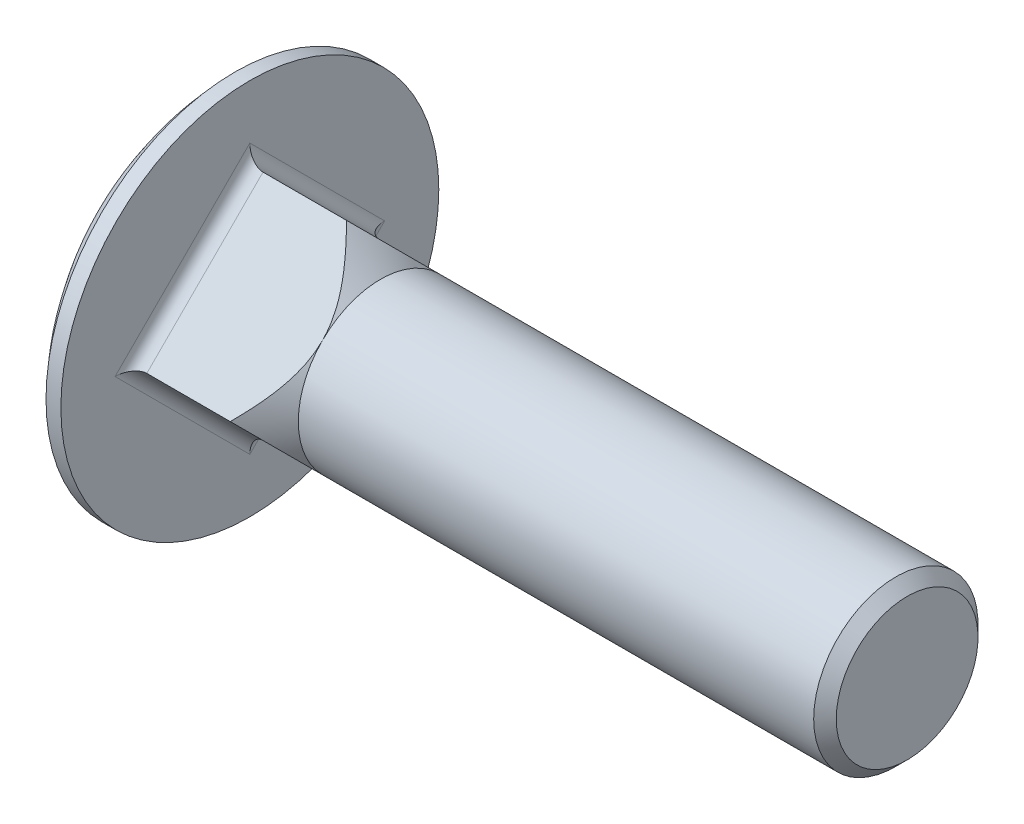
ISO-10303-21;
HEADER;
FILE_DESCRIPTION(('STEP AP214'),'2;1');
FILE_NAME('part.step','',(''),(''),'','','');
FILE_SCHEMA(('AUTOMOTIVE_DESIGN { 1 0 10303 214 1 1 1 1 }'));
ENDSEC;
DATA;
#1=APPLICATION_CONTEXT('core data for automotive mechanical design processes');
#2=APPLICATION_PROTOCOL_DEFINITION('international standard','automotive_design',2000,#1);
#3=PRODUCT_CONTEXT('',#1,'mechanical');
#4=PRODUCT('Part','Part','',(#3));
#5=PRODUCT_RELATED_PRODUCT_CATEGORY('part','',(#4));
#6=PRODUCT_DEFINITION_FORMATION('','',#4);
#7=PRODUCT_DEFINITION_CONTEXT('part definition',#1,'design');
#8=PRODUCT_DEFINITION('design','',#6,#7);
#9=PRODUCT_DEFINITION_SHAPE('','',#8);
#10=(LENGTH_UNIT() NAMED_UNIT(*) SI_UNIT(.MILLI.,.METRE.));
#11=(NAMED_UNIT(*) PLANE_ANGLE_UNIT() SI_UNIT($,.RADIAN.));
#12=(NAMED_UNIT(*) SI_UNIT($,.STERADIAN.) SOLID_ANGLE_UNIT());
#13=UNCERTAINTY_MEASURE_WITH_UNIT(LENGTH_MEASURE(1.E-05),#10,'distance_accuracy_value','');
#14=(GEOMETRIC_REPRESENTATION_CONTEXT(3) GLOBAL_UNCERTAINTY_ASSIGNED_CONTEXT((#13)) GLOBAL_UNIT_ASSIGNED_CONTEXT((#10,
#11,#12)) REPRESENTATION_CONTEXT('',''));
#15=CARTESIAN_POINT('',(0.,0.,0.));
#16=DIRECTION('',(0.,0.,1.));
#17=DIRECTION('',(1.,0.,0.));
#18=AXIS2_PLACEMENT_3D('',#15,#16,#17);
#19=CARTESIAN_POINT('',(26.8,0.,14.1421356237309));
#20=DIRECTION('',(0.,-0.707106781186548,-0.707106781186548));
#21=DIRECTION('',(0.,0.707106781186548,-0.707106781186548));
#22=AXIS2_PLACEMENT_3D('',#19,#20,#21);
#23=PLANE('',#22);
#24=DIRECTION('',(-1.,0.,0.));
#25=VECTOR('',#24,1.);
#26=CARTESIAN_POINT('',(26.8,14.1421356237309,0.));
#27=LINE('',#26,#25);
#28=CARTESIAN_POINT('',(22.6578643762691,14.1421356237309,0.));
#29=VERTEX_POINT('',#28);
#30=CARTESIAN_POINT('',(12.5,14.1421356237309,0.));
#31=VERTEX_POINT('',#30);
#32=EDGE_CURVE('E117',#29,#31,#27,.T.);
#33=ORIENTED_EDGE('',*,*,#32,.T.);
#34=DIRECTION('',(0.,0.707106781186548,-0.707106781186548));
#35=VECTOR('',#34,1.);
#36=CARTESIAN_POINT('',(12.5,0.,14.1421356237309));
#37=LINE('',#36,#35);
#38=CARTESIAN_POINT('',(12.5,0.,14.1421356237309));
#39=VERTEX_POINT('',#38);
#40=EDGE_CURVE('E210',#31,#39,#37,.F.);
#41=ORIENTED_EDGE('',*,*,#40,.T.);
#42=DIRECTION('',(-1.,0.,0.));
#43=VECTOR('',#42,1.);
#44=CARTESIAN_POINT('',(26.8,0.,14.1421356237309));
#45=LINE('',#44,#43);
#46=CARTESIAN_POINT('',(22.6578643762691,0.,14.1421356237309));
#47=VERTEX_POINT('',#46);
#48=EDGE_CURVE('E139',#47,#39,#45,.T.);
#49=ORIENTED_EDGE('',*,*,#48,.F.);
#50=CARTESIAN_POINT('',(22.6576643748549,14.1423356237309,-0.000199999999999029));
#51=CARTESIAN_POINT('',(22.8552392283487,13.9446994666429,0.197436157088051));
#52=CARTESIAN_POINT('',(23.0501556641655,13.7457030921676,0.396432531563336));
#53=CARTESIAN_POINT('',(23.4333984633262,13.3444369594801,0.797698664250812));
#54=CARTESIAN_POINT('',(23.6217218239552,13.1421657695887,0.99996985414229));
#55=CARTESIAN_POINT('',(23.9926271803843,12.7314246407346,1.41071098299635));
#56=CARTESIAN_POINT('',(24.1751080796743,12.5229088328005,1.61922679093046));
#57=CARTESIAN_POINT('',(24.5298995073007,12.1016083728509,2.04052725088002));
#58=CARTESIAN_POINT('',(24.7022111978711,11.8888242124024,2.25331141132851));
#59=CARTESIAN_POINT('',(25.0394769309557,11.4516566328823,2.69047899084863));
#60=CARTESIAN_POINT('',(25.2040327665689,11.2271185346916,2.91501708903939));
#61=CARTESIAN_POINT('',(25.5164765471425,10.7722142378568,3.36992138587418));
#62=CARTESIAN_POINT('',(25.6643613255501,10.5418469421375,3.60028868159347));
#63=CARTESIAN_POINT('',(25.9385679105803,10.0760560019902,4.06607962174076));
#64=CARTESIAN_POINT('',(26.0649930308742,9.84066310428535,4.3014725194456));
#65=CARTESIAN_POINT('',(26.2922366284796,9.36384804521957,4.77828757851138));
#66=CARTESIAN_POINT('',(26.3930711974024,9.1224297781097,5.01970584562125));
#67=CARTESIAN_POINT('',(26.5594298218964,8.64734642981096,5.49478919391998));
#68=CARTESIAN_POINT('',(26.6265684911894,8.41396806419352,5.72816755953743));
#69=CARTESIAN_POINT('',(26.7294988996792,7.94365931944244,6.1984763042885));
#70=CARTESIAN_POINT('',(26.7652837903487,7.70672817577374,6.43540744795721));
#71=CARTESIAN_POINT('',(26.8027880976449,7.23483443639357,6.90730118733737));
#72=CARTESIAN_POINT('',(26.8049784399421,6.99989086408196,7.14224475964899));
#73=CARTESIAN_POINT('',(26.776351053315,6.53102922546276,7.61110639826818));
#74=CARTESIAN_POINT('',(26.7455331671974,6.29711116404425,7.8450244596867));
#75=CARTESIAN_POINT('',(26.6532636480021,5.83397829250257,8.30815733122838));
#76=CARTESIAN_POINT('',(26.5920192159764,5.60474244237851,8.53739318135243));
#77=CARTESIAN_POINT('',(26.4425106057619,5.15076036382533,8.99137525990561));
#78=CARTESIAN_POINT('',(26.3542429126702,4.92601472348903,9.21612090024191));
#79=CARTESIAN_POINT('',(26.153488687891,4.47883245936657,9.66330316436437));
#80=CARTESIAN_POINT('',(26.0407010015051,4.25646429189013,9.88567133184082));
#81=CARTESIAN_POINT('',(25.7957378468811,3.81720389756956,10.3249317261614));
#82=CARTESIAN_POINT('',(25.6635628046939,3.60031155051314,10.5418240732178));
#83=CARTESIAN_POINT('',(25.325134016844,3.0824777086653,11.0596579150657));
#84=CARTESIAN_POINT('',(25.1109497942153,2.78414006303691,11.357995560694));
#85=CARTESIAN_POINT('',(24.6590340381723,2.19639988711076,11.9457357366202));
#86=CARTESIAN_POINT('',(24.4212871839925,1.90700333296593,12.235132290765));
#87=CARTESIAN_POINT('',(24.0552264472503,1.48299272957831,12.6591428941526));
#88=CARTESIAN_POINT('',(23.9336313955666,1.34544247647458,12.7966931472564));
#89=CARTESIAN_POINT('',(23.6868013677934,1.07197750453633,13.0701581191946));
#90=CARTESIAN_POINT('',(23.5615663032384,0.936062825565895,13.2060727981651));
#91=CARTESIAN_POINT('',(23.3081456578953,0.665971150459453,13.4761644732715));
#92=CARTESIAN_POINT('',(23.1799657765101,0.531791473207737,13.6103441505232));
#93=CARTESIAN_POINT('',(22.9208176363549,0.26480345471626,13.8773321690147));
#94=CARTESIAN_POINT('',(22.7898496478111,0.131994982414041,14.0101406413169));
#95=CARTESIAN_POINT('',(22.6576643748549,-0.000200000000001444,14.1423356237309));
#96=B_SPLINE_CURVE_WITH_KNOTS('',3,(#50,#51,#52,#53,#54,#55,#56,#57,#58,#59,#60,#61,#62,#63,#64,
#65,#66,#67,#68,#69,#70,#71,#72,#73,#74,#75,#76,#77,#78,#79,#80,#81,#82,#83,#84,#85,#86,#87,#88,
#89,#90,#91,#92,#93,#94,#95),.UNSPECIFIED.,.F.,.F.,(4,2,2,2,2,2,2,2,2,2,2,2,2,2,2,2,2,2,2,2,2,2,
4),(0.,1.02687972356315,2.05422119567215,3.09439498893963,4.13444967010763,5.20700647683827,
6.27976666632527,7.3472059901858,8.41397242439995,9.42305133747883,10.4323506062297,
11.4274884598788,12.4226310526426,13.4110878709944,14.3996733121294,15.4011657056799,
16.4026360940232,17.8210687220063,19.2404297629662,19.9286061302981,20.6167992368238,
21.3037570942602,21.990648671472),.UNSPECIFIED.);
#97=CARTESIAN_POINT('',(26.8,7.07106781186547,7.07106781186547));
#98=VERTEX_POINT('',#97);
#99=EDGE_CURVE('E118',#98,#47,#96,.T.);
#100=ORIENTED_EDGE('',*,*,#99,.F.);
#101=EDGE_CURVE('E105',#29,#98,#96,.T.);
#102=ORIENTED_EDGE('',*,*,#101,.F.);
#103=EDGE_LOOP('',(#33,#41,#49,#100,#102));
#104=FACE_BOUND('',#103,.T.);
#105=ADVANCED_FACE('F37',(#104),#23,.F.);
#106=CARTESIAN_POINT('',(26.8,-14.1421356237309,0.));
#107=DIRECTION('',(0.,0.707106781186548,-0.707106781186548));
#108=DIRECTION('',(0.,0.707106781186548,0.707106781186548));
#109=AXIS2_PLACEMENT_3D('',#106,#107,#108);
#110=PLANE('',#109);
#111=ORIENTED_EDGE('',*,*,#48,.T.);
#112=DIRECTION('',(0.,0.707106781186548,0.707106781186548));
#113=VECTOR('',#112,1.);
#114=CARTESIAN_POINT('',(12.5,-14.1421356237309,0.));
#115=LINE('',#114,#113);
#116=CARTESIAN_POINT('',(12.5,-14.1421356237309,0.));
#117=VERTEX_POINT('',#116);
#118=EDGE_CURVE('E61',#39,#117,#115,.F.);
#119=ORIENTED_EDGE('',*,*,#118,.T.);
#120=DIRECTION('',(-1.,0.,0.));
#121=VECTOR('',#120,1.);
#122=CARTESIAN_POINT('',(26.8,-14.1421356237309,0.));
#123=LINE('',#122,#121);
#124=CARTESIAN_POINT('',(22.6578643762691,-14.1421356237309,0.));
#125=VERTEX_POINT('',#124);
#126=EDGE_CURVE('E186',#125,#117,#123,.T.);
#127=ORIENTED_EDGE('',*,*,#126,.F.);
#128=CARTESIAN_POINT('',(22.6576643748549,0.000199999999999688,14.1423356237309));
#129=CARTESIAN_POINT('',(22.8552392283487,-0.197436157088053,13.9446994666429));
#130=CARTESIAN_POINT('',(23.0501556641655,-0.396432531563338,13.7457030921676));
#131=CARTESIAN_POINT('',(23.4333984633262,-0.797698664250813,13.3444369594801));
#132=CARTESIAN_POINT('',(23.6217218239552,-0.99996985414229,13.1421657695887));
#133=CARTESIAN_POINT('',(23.9926271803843,-1.41071098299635,12.7314246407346));
#134=CARTESIAN_POINT('',(24.1751080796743,-1.61922679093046,12.5229088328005));
#135=CARTESIAN_POINT('',(24.5298995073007,-2.04052725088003,12.1016083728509));
#136=CARTESIAN_POINT('',(24.7022111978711,-2.25331141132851,11.8888242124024));
#137=CARTESIAN_POINT('',(25.0394769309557,-2.69047899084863,11.4516566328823));
#138=CARTESIAN_POINT('',(25.2040327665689,-2.91501708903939,11.2271185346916));
#139=CARTESIAN_POINT('',(25.5164765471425,-3.36992138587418,10.7722142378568));
#140=CARTESIAN_POINT('',(25.6643613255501,-3.60028868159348,10.5418469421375));
#141=CARTESIAN_POINT('',(25.9385679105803,-4.06607962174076,10.0760560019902));
#142=CARTESIAN_POINT('',(26.0649930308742,-4.3014725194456,9.84066310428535));
#143=CARTESIAN_POINT('',(26.2922366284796,-4.77828757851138,9.36384804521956));
#144=CARTESIAN_POINT('',(26.3930711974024,-5.01970584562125,9.12242977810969));
#145=CARTESIAN_POINT('',(26.5594298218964,-5.49478919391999,8.64734642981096));
#146=CARTESIAN_POINT('',(26.6265684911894,-5.72816755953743,8.41396806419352));
#147=CARTESIAN_POINT('',(26.7294988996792,-6.19847630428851,7.94365931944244));
#148=CARTESIAN_POINT('',(26.7652837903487,-6.43540744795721,7.70672817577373));
#149=CARTESIAN_POINT('',(26.8027880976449,-6.90730118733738,7.23483443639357));
#150=CARTESIAN_POINT('',(26.8049784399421,-7.14224475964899,6.99989086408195));
#151=CARTESIAN_POINT('',(26.776351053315,-7.61110639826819,6.53102922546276));
#152=CARTESIAN_POINT('',(26.7455331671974,-7.8450244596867,6.29711116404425));
#153=CARTESIAN_POINT('',(26.6532636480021,-8.30815733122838,5.83397829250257));
#154=CARTESIAN_POINT('',(26.5920192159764,-8.53739318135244,5.60474244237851));
#155=CARTESIAN_POINT('',(26.4425106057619,-8.99137525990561,5.15076036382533));
#156=CARTESIAN_POINT('',(26.3542429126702,-9.21612090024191,4.92601472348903));
#157=CARTESIAN_POINT('',(26.153488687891,-9.66330316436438,4.47883245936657));
#158=CARTESIAN_POINT('',(26.0407010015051,-9.88567133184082,4.25646429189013));
#159=CARTESIAN_POINT('',(25.7957378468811,-10.3249317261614,3.81720389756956));
#160=CARTESIAN_POINT('',(25.6635628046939,-10.5418240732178,3.60031155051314));
#161=CARTESIAN_POINT('',(25.325134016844,-11.0596579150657,3.0824777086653));
#162=CARTESIAN_POINT('',(25.1109497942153,-11.357995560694,2.78414006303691));
#163=CARTESIAN_POINT('',(24.6590340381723,-11.9457357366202,2.19639988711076));
#164=CARTESIAN_POINT('',(24.4212871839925,-12.235132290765,1.90700333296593));
#165=CARTESIAN_POINT('',(24.0552264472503,-12.6591428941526,1.48299272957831));
#166=CARTESIAN_POINT('',(23.9336313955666,-12.7966931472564,1.34544247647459));
#167=CARTESIAN_POINT('',(23.6868013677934,-13.0701581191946,1.07197750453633));
#168=CARTESIAN_POINT('',(23.5615663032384,-13.206072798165,0.936062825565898));
#169=CARTESIAN_POINT('',(23.3081456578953,-13.4761644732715,0.665971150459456));
#170=CARTESIAN_POINT('',(23.1799657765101,-13.6103441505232,0.531791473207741));
#171=CARTESIAN_POINT('',(22.9208176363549,-13.8773321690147,0.264803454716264));
#172=CARTESIAN_POINT('',(22.7898496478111,-14.0101406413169,0.131994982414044));
#173=CARTESIAN_POINT('',(22.6576643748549,-14.1423356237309,-0.000200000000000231));
#174=B_SPLINE_CURVE_WITH_KNOTS('',3,(#128,#129,#130,#131,#132,#133,#134,#135,#136,#137,#138,
#139,#140,#141,#142,#143,#144,#145,#146,#147,#148,#149,#150,#151,#152,#153,#154,#155,#156,#157,
#158,#159,#160,#161,#162,#163,#164,#165,#166,#167,#168,#169,#170,#171,#172,#173),.UNSPECIFIED.,
.F.,.F.,(4,2,2,2,2,2,2,2,2,2,2,2,2,2,2,2,2,2,2,2,2,2,4),(0.,1.02687972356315,2.05422119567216,
3.09439498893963,4.13444967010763,5.20700647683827,6.27976666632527,7.3472059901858,
8.41397242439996,9.42305133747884,10.4323506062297,11.4274884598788,12.4226310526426,
13.4110878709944,14.3996733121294,15.4011657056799,16.4026360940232,17.8210687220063,
19.2404297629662,19.9286061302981,20.6167992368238,21.3037570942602,21.990648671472),.UNSPECIFIED.);
#175=CARTESIAN_POINT('',(26.8,-7.07106781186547,7.07106781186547));
#176=VERTEX_POINT('',#175);
#177=EDGE_CURVE('E140',#176,#125,#174,.T.);
#178=ORIENTED_EDGE('',*,*,#177,.F.);
#179=EDGE_CURVE('E126',#47,#176,#174,.T.);
#180=ORIENTED_EDGE('',*,*,#179,.F.);
#181=EDGE_LOOP('',(#111,#119,#127,#178,#180));
#182=FACE_BOUND('',#181,.T.);
#183=ADVANCED_FACE('F179',(#182),#110,.F.);
#184=CARTESIAN_POINT('',(26.8,0.,-14.1421356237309));
#185=DIRECTION('',(0.,0.707106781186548,0.707106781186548));
#186=DIRECTION('',(0.,-0.707106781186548,0.707106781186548));
#187=AXIS2_PLACEMENT_3D('',#184,#185,#186);
#188=PLANE('',#187);
#189=ORIENTED_EDGE('',*,*,#126,.T.);
#190=DIRECTION('',(0.,-0.707106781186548,0.707106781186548));
#191=VECTOR('',#190,1.);
#192=CARTESIAN_POINT('',(12.5,0.,-14.1421356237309));
#193=LINE('',#192,#191);
#194=CARTESIAN_POINT('',(12.5,0.,-14.1421356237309));
#195=VERTEX_POINT('',#194);
#196=EDGE_CURVE('E46',#117,#195,#193,.F.);
#197=ORIENTED_EDGE('',*,*,#196,.T.);
#198=DIRECTION('',(-1.,0.,0.));
#199=VECTOR('',#198,1.);
#200=CARTESIAN_POINT('',(26.8,0.,-14.1421356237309));
#201=LINE('',#200,#199);
#202=CARTESIAN_POINT('',(22.6578643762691,0.,-14.1421356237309));
#203=VERTEX_POINT('',#202);
#204=EDGE_CURVE('E191',#203,#195,#201,.T.);
#205=ORIENTED_EDGE('',*,*,#204,.F.);
#206=CARTESIAN_POINT('',(22.6576643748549,-14.1423356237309,0.000199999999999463));
#207=CARTESIAN_POINT('',(22.8552392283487,-13.9446994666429,-0.197436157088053));
#208=CARTESIAN_POINT('',(23.0501556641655,-13.7457030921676,-0.396432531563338));
#209=CARTESIAN_POINT('',(23.4333984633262,-13.3444369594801,-0.797698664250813));
#210=CARTESIAN_POINT('',(23.6217218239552,-13.1421657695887,-0.99996985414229));
#211=CARTESIAN_POINT('',(23.9926271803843,-12.7314246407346,-1.41071098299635));
#212=CARTESIAN_POINT('',(24.1751080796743,-12.5229088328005,-1.61922679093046));
#213=CARTESIAN_POINT('',(24.5298995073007,-12.1016083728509,-2.04052725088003));
#214=CARTESIAN_POINT('',(24.7022111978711,-11.8888242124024,-2.25331141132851));
#215=CARTESIAN_POINT('',(25.0394769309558,-11.4516566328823,-2.69047899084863));
#216=CARTESIAN_POINT('',(25.2040327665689,-11.2271185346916,-2.91501708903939));
#217=CARTESIAN_POINT('',(25.5164765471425,-10.7722142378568,-3.36992138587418));
#218=CARTESIAN_POINT('',(25.6643613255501,-10.5418469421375,-3.60028868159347));
#219=CARTESIAN_POINT('',(25.9385679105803,-10.0760560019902,-4.06607962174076));
#220=CARTESIAN_POINT('',(26.0649930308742,-9.84066310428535,-4.3014725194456));
#221=CARTESIAN_POINT('',(26.2922366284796,-9.36384804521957,-4.77828757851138));
#222=CARTESIAN_POINT('',(26.3930711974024,-9.1224297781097,-5.01970584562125));
#223=CARTESIAN_POINT('',(26.5594298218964,-8.64734642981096,-5.49478919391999));
#224=CARTESIAN_POINT('',(26.6265684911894,-8.41396806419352,-5.72816755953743));
#225=CARTESIAN_POINT('',(26.7294988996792,-7.94365931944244,-6.19847630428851));
#226=CARTESIAN_POINT('',(26.7652837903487,-7.70672817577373,-6.43540744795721));
#227=CARTESIAN_POINT('',(26.8027880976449,-7.23483443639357,-6.90730118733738));
#228=CARTESIAN_POINT('',(26.8049784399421,-6.99989086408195,-7.142244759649));
#229=CARTESIAN_POINT('',(26.776351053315,-6.53102922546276,-7.61110639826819));
#230=CARTESIAN_POINT('',(26.7455331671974,-6.29711116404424,-7.8450244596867));
#231=CARTESIAN_POINT('',(26.6532636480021,-5.83397829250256,-8.30815733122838));
#232=CARTESIAN_POINT('',(26.5920192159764,-5.60474244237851,-8.53739318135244));
#233=CARTESIAN_POINT('',(26.4425106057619,-5.15076036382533,-8.99137525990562));
#234=CARTESIAN_POINT('',(26.3542429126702,-4.92601472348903,-9.21612090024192));
#235=CARTESIAN_POINT('',(26.153488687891,-4.47883245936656,-9.66330316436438));
#236=CARTESIAN_POINT('',(26.0407010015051,-4.25646429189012,-9.88567133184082));
#237=CARTESIAN_POINT('',(25.7957378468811,-3.81720389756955,-10.3249317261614));
#238=CARTESIAN_POINT('',(25.6635628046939,-3.60031155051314,-10.5418240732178));
#239=CARTESIAN_POINT('',(25.325134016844,-3.08247770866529,-11.0596579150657));
#240=CARTESIAN_POINT('',(25.1109497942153,-2.78414006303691,-11.357995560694));
#241=CARTESIAN_POINT('',(24.6590340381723,-2.19639988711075,-11.9457357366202));
#242=CARTESIAN_POINT('',(24.4212871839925,-1.90700333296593,-12.235132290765));
#243=CARTESIAN_POINT('',(24.0552264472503,-1.48299272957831,-12.6591428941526));
#244=CARTESIAN_POINT('',(23.9336313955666,-1.34544247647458,-12.7966931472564));
#245=CARTESIAN_POINT('',(23.6868013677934,-1.07197750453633,-13.0701581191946));
#246=CARTESIAN_POINT('',(23.5615663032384,-0.936062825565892,-13.2060727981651));
#247=CARTESIAN_POINT('',(23.3081456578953,-0.66597115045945,-13.4761644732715));
#248=CARTESIAN_POINT('',(23.1799657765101,-0.531791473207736,-13.6103441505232));
#249=CARTESIAN_POINT('',(22.9208176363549,-0.26480345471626,-13.8773321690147));
#250=CARTESIAN_POINT('',(22.7898496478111,-0.131994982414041,-14.0101406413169));
#251=CARTESIAN_POINT('',(22.6576643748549,0.000200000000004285,-14.142335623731));
#252=B_SPLINE_CURVE_WITH_KNOTS('',3,(#206,#207,#208,#209,#210,#211,#212,#213,#214,#215,#216,
#217,#218,#219,#220,#221,#222,#223,#224,#225,#226,#227,#228,#229,#230,#231,#232,#233,#234,#235,
#236,#237,#238,#239,#240,#241,#242,#243,#244,#245,#246,#247,#248,#249,#250,#251),.UNSPECIFIED.,
.F.,.F.,(4,2,2,2,2,2,2,2,2,2,2,2,2,2,2,2,2,2,2,2,2,2,4),(0.,1.02687972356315,2.05422119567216,
3.09439498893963,4.13444967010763,5.20700647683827,6.27976666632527,7.3472059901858,
8.41397242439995,9.42305133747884,10.4323506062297,11.4274884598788,12.4226310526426,
13.4110878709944,14.3996733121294,15.4011657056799,16.4026360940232,17.8210687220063,
19.2404297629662,19.9286061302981,20.6167992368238,21.3037570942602,21.990648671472),.UNSPECIFIED.);
#253=CARTESIAN_POINT('',(26.8,-7.07106781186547,-7.07106781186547));
#254=VERTEX_POINT('',#253);
#255=EDGE_CURVE('E170',#254,#203,#252,.T.);
#256=ORIENTED_EDGE('',*,*,#255,.F.);
#257=EDGE_CURVE('E174',#125,#254,#252,.T.);
#258=ORIENTED_EDGE('',*,*,#257,.F.);
#259=EDGE_LOOP('',(#189,#197,#205,#256,#258));
#260=FACE_BOUND('',#259,.T.);
#261=ADVANCED_FACE('F176',(#260),#188,.F.);
#262=CARTESIAN_POINT('',(26.8,14.1421356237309,0.));
#263=DIRECTION('',(0.,-0.707106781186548,0.707106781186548));
#264=DIRECTION('',(0.,-0.707106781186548,-0.707106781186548));
#265=AXIS2_PLACEMENT_3D('',#262,#263,#264);
#266=PLANE('',#265);
#267=ORIENTED_EDGE('',*,*,#204,.T.);
#268=DIRECTION('',(0.,-0.707106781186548,-0.707106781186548));
#269=VECTOR('',#268,1.);
#270=CARTESIAN_POINT('',(12.5,14.1421356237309,0.));
#271=LINE('',#270,#269);
#272=EDGE_CURVE('E11',#195,#31,#271,.F.);
#273=ORIENTED_EDGE('',*,*,#272,.T.);
#274=ORIENTED_EDGE('',*,*,#32,.F.);
#275=CARTESIAN_POINT('',(22.6576643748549,-0.000200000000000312,-14.1423356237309));
#276=CARTESIAN_POINT('',(22.8552392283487,0.197436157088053,-13.9446994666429));
#277=CARTESIAN_POINT('',(23.0501556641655,0.396432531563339,-13.7457030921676));
#278=CARTESIAN_POINT('',(23.4333984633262,0.797698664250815,-13.3444369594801));
#279=CARTESIAN_POINT('',(23.6217218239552,0.999969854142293,-13.1421657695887));
#280=CARTESIAN_POINT('',(23.9926271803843,1.41071098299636,-12.7314246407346));
#281=CARTESIAN_POINT('',(24.1751080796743,1.61922679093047,-12.5229088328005));
#282=CARTESIAN_POINT('',(24.5298995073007,2.04052725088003,-12.1016083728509));
#283=CARTESIAN_POINT('',(24.7022111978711,2.25331141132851,-11.8888242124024));
#284=CARTESIAN_POINT('',(25.0394769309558,2.69047899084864,-11.4516566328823));
#285=CARTESIAN_POINT('',(25.2040327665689,2.91501708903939,-11.2271185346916));
#286=CARTESIAN_POINT('',(25.5164765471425,3.36992138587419,-10.7722142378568));
#287=CARTESIAN_POINT('',(25.6643613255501,3.60028868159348,-10.5418469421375));
#288=CARTESIAN_POINT('',(25.9385679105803,4.06607962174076,-10.0760560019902));
#289=CARTESIAN_POINT('',(26.0649930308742,4.3014725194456,-9.84066310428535));
#290=CARTESIAN_POINT('',(26.2922366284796,4.77828757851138,-9.36384804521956));
#291=CARTESIAN_POINT('',(26.3930711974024,5.01970584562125,-9.12242977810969));
#292=CARTESIAN_POINT('',(26.5594298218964,5.49478919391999,-8.64734642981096));
#293=CARTESIAN_POINT('',(26.6265684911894,5.72816755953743,-8.41396806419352));
#294=CARTESIAN_POINT('',(26.7294988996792,6.19847630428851,-7.94365931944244));
#295=CARTESIAN_POINT('',(26.7652837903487,6.43540744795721,-7.70672817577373));
#296=CARTESIAN_POINT('',(26.8027880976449,6.90730118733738,-7.23483443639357));
#297=CARTESIAN_POINT('',(26.8049784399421,7.142244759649,-6.99989086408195));
#298=CARTESIAN_POINT('',(26.776351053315,7.61110639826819,-6.53102922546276));
#299=CARTESIAN_POINT('',(26.7455331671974,7.8450244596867,-6.29711116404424));
#300=CARTESIAN_POINT('',(26.6532636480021,8.30815733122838,-5.83397829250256));
#301=CARTESIAN_POINT('',(26.5920192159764,8.53739318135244,-5.60474244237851));
#302=CARTESIAN_POINT('',(26.4425106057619,8.99137525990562,-5.15076036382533));
#303=CARTESIAN_POINT('',(26.3542429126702,9.21612090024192,-4.92601472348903));
#304=CARTESIAN_POINT('',(26.153488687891,9.66330316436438,-4.47883245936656));
#305=CARTESIAN_POINT('',(26.0407010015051,9.88567133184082,-4.25646429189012));
#306=CARTESIAN_POINT('',(25.7957378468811,10.3249317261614,-3.81720389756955));
#307=CARTESIAN_POINT('',(25.6635628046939,10.5418240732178,-3.60031155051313));
#308=CARTESIAN_POINT('',(25.325134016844,11.0596579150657,-3.08247770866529));
#309=CARTESIAN_POINT('',(25.1109497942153,11.357995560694,-2.78414006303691));
#310=CARTESIAN_POINT('',(24.6590340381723,11.9457357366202,-2.19639988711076));
#311=CARTESIAN_POINT('',(24.4212871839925,12.235132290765,-1.90700333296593));
#312=CARTESIAN_POINT('',(24.0552264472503,12.6591428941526,-1.48299272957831));
#313=CARTESIAN_POINT('',(23.9336313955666,12.7966931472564,-1.34544247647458));
#314=CARTESIAN_POINT('',(23.6868013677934,13.0701581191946,-1.07197750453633));
#315=CARTESIAN_POINT('',(23.5615663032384,13.2060727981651,-0.936062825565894));
#316=CARTESIAN_POINT('',(23.3081456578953,13.4761644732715,-0.665971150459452));
#317=CARTESIAN_POINT('',(23.1799657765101,13.6103441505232,-0.531791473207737));
#318=CARTESIAN_POINT('',(22.9208176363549,13.8773321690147,-0.264803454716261));
#319=CARTESIAN_POINT('',(22.7898496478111,14.0101406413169,-0.131994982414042));
#320=CARTESIAN_POINT('',(22.6576643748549,14.1423356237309,0.000200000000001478));
#321=B_SPLINE_CURVE_WITH_KNOTS('',3,(#275,#276,#277,#278,#279,#280,#281,#282,#283,#284,#285,
#286,#287,#288,#289,#290,#291,#292,#293,#294,#295,#296,#297,#298,#299,#300,#301,#302,#303,#304,
#305,#306,#307,#308,#309,#310,#311,#312,#313,#314,#315,#316,#317,#318,#319,#320),.UNSPECIFIED.,
.F.,.F.,(4,2,2,2,2,2,2,2,2,2,2,2,2,2,2,2,2,2,2,2,2,2,4),(0.,1.02687972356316,2.05422119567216,
3.09439498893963,4.13444967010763,5.20700647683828,6.27976666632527,7.34720599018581,
8.41397242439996,9.42305133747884,10.4323506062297,11.4274884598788,12.4226310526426,
13.4110878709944,14.3996733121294,15.4011657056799,16.4026360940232,17.8210687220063,
19.2404297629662,19.9286061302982,20.6167992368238,21.3037570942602,21.990648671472),.UNSPECIFIED.);
#322=CARTESIAN_POINT('',(26.8,7.07106781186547,-7.07106781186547));
#323=VERTEX_POINT('',#322);
#324=EDGE_CURVE('E112',#323,#29,#321,.T.);
#325=ORIENTED_EDGE('',*,*,#324,.F.);
#326=EDGE_CURVE('E175',#203,#323,#321,.T.);
#327=ORIENTED_EDGE('',*,*,#326,.F.);
#328=EDGE_LOOP('',(#267,#273,#274,#325,#327));
#329=FACE_BOUND('',#328,.T.);
#330=ADVANCED_FACE('F160',(#329),#266,.F.);
#331=CARTESIAN_POINT('',(33.641289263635,0.,0.));
#332=DIRECTION('',(-1.,0.,0.));
#333=DIRECTION('',(0.,1.,0.));
#334=AXIS2_PLACEMENT_3D('',#331,#332,#333);
#335=SPHERICAL_SURFACE('',#334,33.641289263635);
#336=CARTESIAN_POINT('',(9.09059999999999,0.,0.));
#337=DIRECTION('',(-1.,0.,0.));
#338=DIRECTION('',(0.,0.,1.));
#339=AXIS2_PLACEMENT_3D('',#336,#337,#338);
#340=CIRCLE('',#339,23.);
#341=CARTESIAN_POINT('',(9.09059999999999,0.,23.));
#342=VERTEX_POINT('',#341);
#343=EDGE_CURVE('E185',#342,#342,#340,.T.);
#344=ORIENTED_EDGE('',*,*,#343,.T.);
#345=EDGE_LOOP('',(#344));
#346=FACE_BOUND('',#345,.T.);
#347=ADVANCED_FACE('F250',(#346),#335,.T.);
#348=CARTESIAN_POINT('',(-31.75,0.,0.));
#349=DIRECTION('',(-1.,0.,0.));
#350=DIRECTION('',(0.,0.,1.));
#351=AXIS2_PLACEMENT_3D('',#348,#349,#350);
#352=CYLINDRICAL_SURFACE('',#351,23.);
#353=CARTESIAN_POINT('',(10.9,0.,0.));
#354=DIRECTION('',(-1.,0.,0.));
#355=DIRECTION('',(0.,0.,1.));
#356=AXIS2_PLACEMENT_3D('',#353,#354,#355);
#357=CIRCLE('',#356,23.);
#358=CARTESIAN_POINT('',(10.9,0.,23.));
#359=VERTEX_POINT('',#358);
#360=EDGE_CURVE('E189',#359,#359,#357,.T.);
#361=ORIENTED_EDGE('',*,*,#360,.T.);
#362=EDGE_LOOP('',(#361));
#363=FACE_BOUND('',#362,.T.);
#364=ORIENTED_EDGE('',*,*,#343,.F.);
#365=EDGE_LOOP('',(#364));
#366=FACE_BOUND('',#365,.T.);
#367=ADVANCED_FACE('F253',(#363,#366),#352,.T.);
#368=CARTESIAN_POINT('',(10.9,23.,0.));
#369=DIRECTION('',(1.,0.,0.));
#370=DIRECTION('',(0.,0.,-1.));
#371=AXIS2_PLACEMENT_3D('',#368,#369,#370);
#372=PLANE('',#371);
#373=DIRECTION('',(0.,0.707106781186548,0.707106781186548));
#374=VECTOR('',#373,1.);
#375=CARTESIAN_POINT('',(10.9,3.29756133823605,19.7024386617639));
#376=LINE('',#375,#374);
#377=CARTESIAN_POINT('',(10.9,-16.4048773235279,0.));
#378=VERTEX_POINT('',#377);
#379=CARTESIAN_POINT('',(10.9,0.,16.4048773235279));
#380=VERTEX_POINT('',#379);
#381=EDGE_CURVE('E205',#378,#380,#376,.T.);
#382=ORIENTED_EDGE('',*,*,#381,.T.);
#383=DIRECTION('',(0.,0.707106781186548,-0.707106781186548));
#384=VECTOR('',#383,1.);
#385=CARTESIAN_POINT('',(10.9,19.702438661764,-3.29756133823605));
#386=LINE('',#385,#384);
#387=CARTESIAN_POINT('',(10.9,16.4048773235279,0.));
#388=VERTEX_POINT('',#387);
#389=EDGE_CURVE('E207',#380,#388,#386,.T.);
#390=ORIENTED_EDGE('',*,*,#389,.T.);
#391=DIRECTION('',(0.,-0.707106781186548,-0.707106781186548));
#392=VECTOR('',#391,1.);
#393=CARTESIAN_POINT('',(10.9,19.7024386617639,3.29756133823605));
#394=LINE('',#393,#392);
#395=CARTESIAN_POINT('',(10.9,0.,-16.4048773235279));
#396=VERTEX_POINT('',#395);
#397=EDGE_CURVE('E201',#388,#396,#394,.T.);
#398=ORIENTED_EDGE('',*,*,#397,.T.);
#399=DIRECTION('',(0.,-0.707106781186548,0.707106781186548));
#400=VECTOR('',#399,1.);
#401=CARTESIAN_POINT('',(10.9,3.29756133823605,-19.7024386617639));
#402=LINE('',#401,#400);
#403=EDGE_CURVE('E203',#396,#378,#402,.T.);
#404=ORIENTED_EDGE('',*,*,#403,.T.);
#405=EDGE_LOOP('',(#382,#390,#398,#404));
#406=FACE_BOUND('',#405,.T.);
#407=ORIENTED_EDGE('',*,*,#360,.F.);
#408=EDGE_LOOP('',(#407));
#409=FACE_BOUND('',#408,.T.);
#410=ADVANCED_FACE('F266',(#406,#409),#372,.T.);
#411=CARTESIAN_POINT('',(12.8000000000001,0.,0.));
#412=DIRECTION('',(-1.,0.,0.));
#413=DIRECTION('',(0.,0.,1.));
#414=AXIS2_PLACEMENT_3D('',#411,#412,#413);
#415=CONICAL_SURFACE('',#414,24.,0.78539816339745);
#416=ORIENTED_EDGE('',*,*,#99,.T.);
#417=ORIENTED_EDGE('',*,*,#179,.T.);
#418=CARTESIAN_POINT('',(26.8,0.,0.));
#419=DIRECTION('',(-1.,0.,0.));
#420=DIRECTION('',(0.,0.,1.));
#421=AXIS2_PLACEMENT_3D('',#418,#419,#420);
#422=CIRCLE('',#421,10.);
#423=EDGE_CURVE('E123',#98,#176,#422,.F.);
#424=ORIENTED_EDGE('',*,*,#423,.F.);
#425=EDGE_LOOP('',(#416,#417,#424));
#426=FACE_BOUND('',#425,.T.);
#427=ADVANCED_FACE('F124',(#426),#415,.T.);
#428=ORIENTED_EDGE('',*,*,#101,.T.);
#429=EDGE_CURVE('E109',#323,#98,#422,.F.);
#430=ORIENTED_EDGE('',*,*,#429,.F.);
#431=ORIENTED_EDGE('',*,*,#324,.T.);
#432=EDGE_LOOP('',(#428,#430,#431));
#433=FACE_BOUND('',#432,.T.);
#434=ADVANCED_FACE('F107',(#433),#415,.T.);
#435=ORIENTED_EDGE('',*,*,#255,.T.);
#436=ORIENTED_EDGE('',*,*,#326,.T.);
#437=EDGE_CURVE('E136',#254,#323,#422,.F.);
#438=ORIENTED_EDGE('',*,*,#437,.F.);
#439=EDGE_LOOP('',(#435,#436,#438));
#440=FACE_BOUND('',#439,.T.);
#441=ADVANCED_FACE('F159',(#440),#415,.T.);
#442=ORIENTED_EDGE('',*,*,#177,.T.);
#443=ORIENTED_EDGE('',*,*,#257,.T.);
#444=EDGE_CURVE('E132',#176,#254,#422,.F.);
#445=ORIENTED_EDGE('',*,*,#444,.F.);
#446=EDGE_LOOP('',(#442,#443,#445));
#447=FACE_BOUND('',#446,.T.);
#448=ADVANCED_FACE('F259',(#447),#415,.T.);
#449=CARTESIAN_POINT('',(90.9,8.626,0.));
#450=DIRECTION('',(1.,0.,0.));
#451=DIRECTION('',(0.,0.,-1.));
#452=AXIS2_PLACEMENT_3D('',#449,#450,#451);
#453=PLANE('',#452);
#454=CARTESIAN_POINT('',(90.9,0.,0.));
#455=DIRECTION('',(-1.,0.,0.));
#456=DIRECTION('',(0.,0.,1.));
#457=AXIS2_PLACEMENT_3D('',#454,#455,#456);
#458=CIRCLE('',#457,8.626);
#459=CARTESIAN_POINT('',(90.9,0.,8.626));
#460=VERTEX_POINT('',#459);
#461=EDGE_CURVE('E130',#460,#460,#458,.T.);
#462=ORIENTED_EDGE('',*,*,#461,.F.);
#463=EDGE_LOOP('',(#462));
#464=FACE_BOUND('',#463,.T.);
#465=ADVANCED_FACE('F255',(#464),#453,.T.);
#466=CARTESIAN_POINT('',(90.9,0.,0.));
#467=DIRECTION('',(-1.,0.,0.));
#468=DIRECTION('',(0.,0.,1.));
#469=AXIS2_PLACEMENT_3D('',#466,#467,#468);
#470=CONICAL_SURFACE('',#469,8.626,0.785398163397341);
#471=CARTESIAN_POINT('',(89.5259999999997,0.,0.));
#472=DIRECTION('',(-1.,0.,0.));
#473=DIRECTION('',(0.,0.,1.));
#474=AXIS2_PLACEMENT_3D('',#471,#472,#473);
#475=CIRCLE('',#474,10.);
#476=CARTESIAN_POINT('',(89.5259999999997,0.,10.));
#477=VERTEX_POINT('',#476);
#478=EDGE_CURVE('E196',#477,#477,#475,.T.);
#479=ORIENTED_EDGE('',*,*,#478,.F.);
#480=EDGE_LOOP('',(#479));
#481=FACE_BOUND('',#480,.T.);
#482=ORIENTED_EDGE('',*,*,#461,.T.);
#483=EDGE_LOOP('',(#482));
#484=FACE_BOUND('',#483,.T.);
#485=ADVANCED_FACE('F258',(#481,#484),#470,.T.);
#486=CARTESIAN_POINT('',(-31.75,0.,0.));
#487=DIRECTION('',(-1.,0.,0.));
#488=DIRECTION('',(0.,0.,1.));
#489=AXIS2_PLACEMENT_3D('',#486,#487,#488);
#490=CYLINDRICAL_SURFACE('',#489,10.);
#491=ORIENTED_EDGE('',*,*,#423,.T.);
#492=ORIENTED_EDGE('',*,*,#444,.T.);
#493=ORIENTED_EDGE('',*,*,#437,.T.);
#494=ORIENTED_EDGE('',*,*,#429,.T.);
#495=EDGE_LOOP('',(#491,#492,#493,#494));
#496=FACE_BOUND('',#495,.T.);
#497=ORIENTED_EDGE('',*,*,#478,.T.);
#498=EDGE_LOOP('',(#497));
#499=FACE_BOUND('',#498,.T.);
#500=ADVANCED_FACE('F133',(#496,#499),#490,.T.);
#501=CARTESIAN_POINT('',(12.5,3.29756133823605,-19.702438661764));
#502=DIRECTION('',(0.,-0.707106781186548,0.707106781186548));
#503=DIRECTION('',(0.,-0.707106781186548,-0.707106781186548));
#504=AXIS2_PLACEMENT_3D('',#501,#502,#503);
#505=CYLINDRICAL_SURFACE('',#504,1.6);
#506=CARTESIAN_POINT('',(12.5,0.,-16.4048773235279));
#507=DIRECTION('',(0.,-1.,0.));
#508=DIRECTION('',(0.,0.,-1.));
#509=AXIS2_PLACEMENT_3D('',#506,#507,#508);
#510=ELLIPSE('',#509,2.26274169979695,1.6);
#511=EDGE_CURVE('E217',#195,#396,#510,.T.);
#512=ORIENTED_EDGE('',*,*,#511,.F.);
#513=ORIENTED_EDGE('',*,*,#196,.F.);
#514=CARTESIAN_POINT('',(12.5,-16.4048773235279,0.));
#515=DIRECTION('',(0.,0.,1.));
#516=DIRECTION('',(0.,-1.,0.));
#517=AXIS2_PLACEMENT_3D('',#514,#515,#516);
#518=ELLIPSE('',#517,2.26274169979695,1.6);
#519=EDGE_CURVE('E41',#378,#117,#518,.F.);
#520=ORIENTED_EDGE('',*,*,#519,.F.);
#521=ORIENTED_EDGE('',*,*,#403,.F.);
#522=EDGE_LOOP('',(#512,#513,#520,#521));
#523=FACE_BOUND('',#522,.T.);
#524=ADVANCED_FACE('F39',(#523),#505,.F.);
#525=CARTESIAN_POINT('',(12.5,3.29756133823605,19.7024386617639));
#526=DIRECTION('',(0.,0.707106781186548,0.707106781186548));
#527=DIRECTION('',(0.,-0.707106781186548,0.707106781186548));
#528=AXIS2_PLACEMENT_3D('',#525,#526,#527);
#529=CYLINDRICAL_SURFACE('',#528,1.6);
#530=ORIENTED_EDGE('',*,*,#519,.T.);
#531=ORIENTED_EDGE('',*,*,#118,.F.);
#532=CARTESIAN_POINT('',(12.5,0.,16.4048773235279));
#533=DIRECTION('',(0.,1.,0.));
#534=DIRECTION('',(0.,0.,1.));
#535=AXIS2_PLACEMENT_3D('',#532,#533,#534);
#536=ELLIPSE('',#535,2.26274169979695,1.6);
#537=EDGE_CURVE('E216',#380,#39,#536,.F.);
#538=ORIENTED_EDGE('',*,*,#537,.F.);
#539=ORIENTED_EDGE('',*,*,#381,.F.);
#540=EDGE_LOOP('',(#530,#531,#538,#539));
#541=FACE_BOUND('',#540,.T.);
#542=ADVANCED_FACE('F240',(#541),#529,.F.);
#543=CARTESIAN_POINT('',(12.5,19.7024386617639,3.29756133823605));
#544=DIRECTION('',(0.,-0.707106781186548,-0.707106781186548));
#545=DIRECTION('',(0.,0.707106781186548,-0.707106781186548));
#546=AXIS2_PLACEMENT_3D('',#543,#544,#545);
#547=CYLINDRICAL_SURFACE('',#546,1.6);
#548=ORIENTED_EDGE('',*,*,#511,.T.);
#549=ORIENTED_EDGE('',*,*,#397,.F.);
#550=CARTESIAN_POINT('',(12.5,16.4048773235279,0.));
#551=DIRECTION('',(0.,0.,-1.));
#552=DIRECTION('',(0.,-1.,0.));
#553=AXIS2_PLACEMENT_3D('',#550,#551,#552);
#554=ELLIPSE('',#553,2.26274169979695,1.6);
#555=EDGE_CURVE('E214',#31,#388,#554,.T.);
#556=ORIENTED_EDGE('',*,*,#555,.F.);
#557=ORIENTED_EDGE('',*,*,#272,.F.);
#558=EDGE_LOOP('',(#548,#549,#556,#557));
#559=FACE_BOUND('',#558,.T.);
#560=ADVANCED_FACE('F235',(#559),#547,.F.);
#561=CARTESIAN_POINT('',(12.5,19.702438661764,-3.29756133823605));
#562=DIRECTION('',(0.,0.707106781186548,-0.707106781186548));
#563=DIRECTION('',(0.,0.707106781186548,0.707106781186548));
#564=AXIS2_PLACEMENT_3D('',#561,#562,#563);
#565=CYLINDRICAL_SURFACE('',#564,1.6);
#566=ORIENTED_EDGE('',*,*,#537,.T.);
#567=ORIENTED_EDGE('',*,*,#40,.F.);
#568=ORIENTED_EDGE('',*,*,#555,.T.);
#569=ORIENTED_EDGE('',*,*,#389,.F.);
#570=EDGE_LOOP('',(#566,#567,#568,#569));
#571=FACE_BOUND('',#570,.T.);
#572=ADVANCED_FACE('F238',(#571),#565,.F.);
#573=CLOSED_SHELL('',(#105,#183,#261,#330,#347,#367,#410,#427,#434,#441,#448,#465,#485,#500,
#524,#542,#560,#572));
#574=MANIFOLD_SOLID_BREP('B2',#573);
#575=ADVANCED_BREP_SHAPE_REPRESENTATION('',(#18,#574),#14);
#576=SHAPE_DEFINITION_REPRESENTATION(#9,#575);
ENDSEC;
END-ISO-10303-21;
